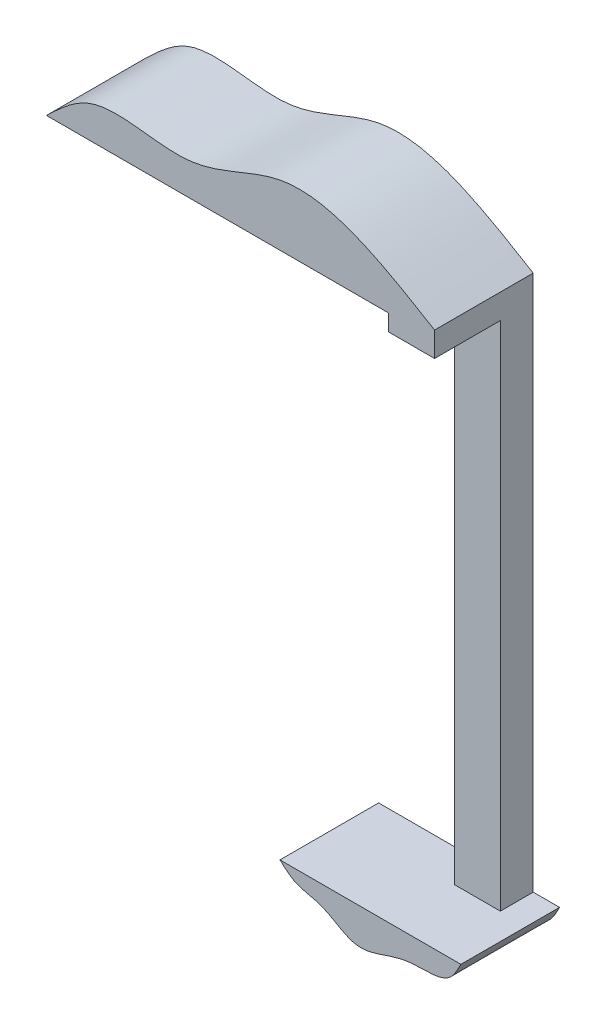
ISO-10303-21;
HEADER;
FILE_DESCRIPTION(('STEP AP214'),'2;1');
FILE_NAME('part.step','',(''),(''),'','','');
FILE_SCHEMA(('AUTOMOTIVE_DESIGN { 1 0 10303 214 1 1 1 1 }'));
ENDSEC;
DATA;
#1=APPLICATION_CONTEXT('core data for automotive mechanical design processes');
#2=APPLICATION_PROTOCOL_DEFINITION('international standard','automotive_design',2000,#1);
#3=PRODUCT_CONTEXT('',#1,'mechanical');
#4=PRODUCT('Part','Part','',(#3));
#5=PRODUCT_RELATED_PRODUCT_CATEGORY('part','',(#4));
#6=PRODUCT_DEFINITION_FORMATION('','',#4);
#7=PRODUCT_DEFINITION_CONTEXT('part definition',#1,'design');
#8=PRODUCT_DEFINITION('design','',#6,#7);
#9=PRODUCT_DEFINITION_SHAPE('','',#8);
#10=(LENGTH_UNIT() NAMED_UNIT(*) SI_UNIT(.MILLI.,.METRE.));
#11=(NAMED_UNIT(*) PLANE_ANGLE_UNIT() SI_UNIT($,.RADIAN.));
#12=(NAMED_UNIT(*) SI_UNIT($,.STERADIAN.) SOLID_ANGLE_UNIT());
#13=UNCERTAINTY_MEASURE_WITH_UNIT(LENGTH_MEASURE(1.E-05),#10,'distance_accuracy_value','');
#14=(GEOMETRIC_REPRESENTATION_CONTEXT(3) GLOBAL_UNCERTAINTY_ASSIGNED_CONTEXT((#13)) GLOBAL_UNIT_ASSIGNED_CONTEXT((#10,
#11,#12)) REPRESENTATION_CONTEXT('',''));
#15=CARTESIAN_POINT('',(0.,0.,0.));
#16=DIRECTION('',(0.,0.,1.));
#17=DIRECTION('',(1.,0.,0.));
#18=AXIS2_PLACEMENT_3D('',#15,#16,#17);
#19=CARTESIAN_POINT('',(-7.53680932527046,-10.4914734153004,30.));
#20=DIRECTION('',(0.,0.,-1.));
#21=DIRECTION('',(-1.,0.,0.));
#22=AXIS2_PLACEMENT_3D('',#19,#20,#21);
#23=PLANE('',#22);
#24=DIRECTION('',(0.,-1.,0.));
#25=VECTOR('',#24,1.);
#26=CARTESIAN_POINT('',(-2.,0.,30.));
#27=LINE('',#26,#25);
#28=CARTESIAN_POINT('',(-2.,160.5,30.));
#29=VERTEX_POINT('',#28);
#30=CARTESIAN_POINT('',(-2.,155.5,30.));
#31=VERTEX_POINT('',#30);
#32=EDGE_CURVE('E119',#29,#31,#27,.T.);
#33=ORIENTED_EDGE('',*,*,#32,.T.);
#34=DIRECTION('',(-1.,0.,0.));
#35=VECTOR('',#34,1.);
#36=CARTESIAN_POINT('',(-14.1,155.5,30.));
#37=LINE('',#36,#35);
#38=CARTESIAN_POINT('',(12.,155.5,30.));
#39=VERTEX_POINT('',#38);
#40=EDGE_CURVE('E107',#39,#31,#37,.T.);
#41=ORIENTED_EDGE('',*,*,#40,.F.);
#42=DIRECTION('',(0.,1.,0.));
#43=VECTOR('',#42,1.);
#44=CARTESIAN_POINT('',(12.,0.,30.));
#45=LINE('',#44,#43);
#46=CARTESIAN_POINT('',(12.,163.,30.));
#47=VERTEX_POINT('',#46);
#48=EDGE_CURVE('E116',#39,#47,#45,.T.);
#49=ORIENTED_EDGE('',*,*,#48,.T.);
#50=CARTESIAN_POINT('',(12.,163.,30.));
#51=CARTESIAN_POINT('',(-3.78610537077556,172.47166546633,30.));
#52=CARTESIAN_POINT('',(-28.8037723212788,187.482269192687,30.));
#53=CARTESIAN_POINT('',(-62.1170521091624,165.146449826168,30.));
#54=CARTESIAN_POINT('',(-89.926880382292,175.83666233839,30.));
#55=CARTESIAN_POINT('',(-101.787873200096,164.519130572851,30.));
#56=CARTESIAN_POINT('',(-106.,160.5,30.));
#57=B_SPLINE_CURVE_WITH_KNOTS('',3,(#50,#51,#52,#53,#54,#55,#56),.UNSPECIFIED.,.F.,.F.,(4,1,1,1,
4),(0.,0.396544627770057,0.628440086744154,0.86805004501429,1.),.UNSPECIFIED.);
#58=CARTESIAN_POINT('',(-106.,160.5,30.));
#59=VERTEX_POINT('',#58);
#60=EDGE_CURVE('E126',#47,#59,#57,.T.);
#61=ORIENTED_EDGE('',*,*,#60,.T.);
#62=DIRECTION('',(1.,0.,0.));
#63=VECTOR('',#62,1.);
#64=CARTESIAN_POINT('',(-2.,160.5,30.));
#65=LINE('',#64,#63);
#66=EDGE_CURVE('E54',#59,#29,#65,.T.);
#67=ORIENTED_EDGE('',*,*,#66,.T.);
#68=EDGE_LOOP('',(#33,#41,#49,#61,#67));
#69=FACE_BOUND('',#68,.T.);
#70=ADVANCED_FACE('F31',(#69),#23,.F.);
#71=CARTESIAN_POINT('',(-35.,0.,30.));
#72=CARTESIAN_POINT('',(-33.5435901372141,-1.33739367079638,30.));
#73=CARTESIAN_POINT('',(-30.0936054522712,-4.50544944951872,30.));
#74=CARTESIAN_POINT('',(-21.2243919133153,-5.05505208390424,30.));
#75=CARTESIAN_POINT('',(-11.0745628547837,-14.0424406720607,30.));
#76=CARTESIAN_POINT('',(1.98997114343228,-5.44906440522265,30.));
#77=CARTESIAN_POINT('',(15.8305218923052,-8.23833926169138,30.));
#78=CARTESIAN_POINT('',(18.9877916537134,-1.99999029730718,30.));
#79=CARTESIAN_POINT('',(20.,0.,30.));
#80=B_SPLINE_CURVE_WITH_KNOTS('',3,(#71,#72,#73,#74,#75,#76,#77,#78,#79),.UNSPECIFIED.,.F.,.F.,
(4,1,1,1,1,1,4),(0.,0.0949203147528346,0.224849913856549,0.420290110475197,0.67892704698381,
0.897065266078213,1.),.UNSPECIFIED.);
#81=DIRECTION('',(0.,0.,-1.));
#82=VECTOR('',#81,1.);
#83=SURFACE_OF_LINEAR_EXTRUSION('',#80,#82);
#84=CARTESIAN_POINT('',(-35.,0.,0.));
#85=CARTESIAN_POINT('',(-33.5435901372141,-1.33739367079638,0.));
#86=CARTESIAN_POINT('',(-30.0936054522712,-4.50544944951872,0.));
#87=CARTESIAN_POINT('',(-21.2243919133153,-5.05505208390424,0.));
#88=CARTESIAN_POINT('',(-11.0745628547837,-14.0424406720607,0.));
#89=CARTESIAN_POINT('',(1.98997114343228,-5.44906440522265,0.));
#90=CARTESIAN_POINT('',(15.8305218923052,-8.23833926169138,0.));
#91=CARTESIAN_POINT('',(18.9877916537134,-1.99999029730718,0.));
#92=CARTESIAN_POINT('',(20.,0.,0.));
#93=B_SPLINE_CURVE_WITH_KNOTS('',3,(#84,#85,#86,#87,#88,#89,#90,#91,#92),.UNSPECIFIED.,.F.,.F.,
(4,1,1,1,1,1,4),(0.,0.0949203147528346,0.224849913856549,0.420290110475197,0.67892704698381,
0.897065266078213,1.),.UNSPECIFIED.);
#94=CARTESIAN_POINT('',(-35.,0.,0.));
#95=VERTEX_POINT('',#94);
#96=CARTESIAN_POINT('',(20.,0.,0.));
#97=VERTEX_POINT('',#96);
#98=EDGE_CURVE('E208',#95,#97,#93,.T.);
#99=ORIENTED_EDGE('',*,*,#98,.T.);
#100=DIRECTION('',(0.,0.,-1.));
#101=VECTOR('',#100,1.);
#102=CARTESIAN_POINT('',(20.,0.,30.));
#103=LINE('',#102,#101);
#104=CARTESIAN_POINT('',(20.,0.,30.));
#105=VERTEX_POINT('',#104);
#106=EDGE_CURVE('E11',#105,#97,#103,.T.);
#107=ORIENTED_EDGE('',*,*,#106,.F.);
#108=CARTESIAN_POINT('',(-35.,0.,30.));
#109=VERTEX_POINT('',#108);
#110=EDGE_CURVE('E129',#109,#105,#80,.T.);
#111=ORIENTED_EDGE('',*,*,#110,.F.);
#112=DIRECTION('',(0.,0.,-1.));
#113=VECTOR('',#112,1.);
#114=CARTESIAN_POINT('',(-35.,0.,30.));
#115=LINE('',#114,#113);
#116=EDGE_CURVE('E174',#109,#95,#115,.T.);
#117=ORIENTED_EDGE('',*,*,#116,.T.);
#118=EDGE_LOOP('',(#99,#107,#111,#117));
#119=FACE_BOUND('',#118,.T.);
#120=ADVANCED_FACE('F33',(#119),#83,.F.);
#121=CARTESIAN_POINT('',(12.,0.,30.));
#122=DIRECTION('',(-1.,0.,0.));
#123=DIRECTION('',(0.,-1.,0.));
#124=AXIS2_PLACEMENT_3D('',#121,#122,#123);
#125=PLANE('',#124);
#126=ORIENTED_EDGE('',*,*,#48,.F.);
#127=DIRECTION('',(0.,0.,1.));
#128=VECTOR('',#127,1.);
#129=CARTESIAN_POINT('',(12.,155.5,10.));
#130=LINE('',#129,#128);
#131=CARTESIAN_POINT('',(12.,155.5,10.));
#132=VERTEX_POINT('',#131);
#133=EDGE_CURVE('E104',#132,#39,#130,.T.);
#134=ORIENTED_EDGE('',*,*,#133,.F.);
#135=DIRECTION('',(0.,1.,0.));
#136=VECTOR('',#135,1.);
#137=CARTESIAN_POINT('',(12.,155.5,10.));
#138=LINE('',#137,#136);
#139=CARTESIAN_POINT('',(12.,0.,10.));
#140=VERTEX_POINT('',#139);
#141=EDGE_CURVE('E219',#140,#132,#138,.T.);
#142=ORIENTED_EDGE('',*,*,#141,.F.);
#143=DIRECTION('',(0.,0.,-1.));
#144=VECTOR('',#143,1.);
#145=CARTESIAN_POINT('',(12.,0.,30.));
#146=LINE('',#145,#144);
#147=CARTESIAN_POINT('',(12.,0.,0.));
#148=VERTEX_POINT('',#147);
#149=EDGE_CURVE('E40',#140,#148,#146,.T.);
#150=ORIENTED_EDGE('',*,*,#149,.T.);
#151=DIRECTION('',(0.,1.,0.));
#152=VECTOR('',#151,1.);
#153=CARTESIAN_POINT('',(12.,0.,0.));
#154=LINE('',#153,#152);
#155=CARTESIAN_POINT('',(12.,163.,0.));
#156=VERTEX_POINT('',#155);
#157=EDGE_CURVE('E200',#148,#156,#154,.T.);
#158=ORIENTED_EDGE('',*,*,#157,.T.);
#159=DIRECTION('',(0.,0.,-1.));
#160=VECTOR('',#159,1.);
#161=CARTESIAN_POINT('',(12.,163.,30.));
#162=LINE('',#161,#160);
#163=EDGE_CURVE('E124',#47,#156,#162,.T.);
#164=ORIENTED_EDGE('',*,*,#163,.F.);
#165=EDGE_LOOP('',(#126,#134,#142,#150,#158,#164));
#166=FACE_BOUND('',#165,.T.);
#167=ADVANCED_FACE('F122',(#166),#125,.F.);
#168=DIRECTION('',(0.,0.,-1.));
#169=VECTOR('',#168,1.);
#170=SURFACE_OF_LINEAR_EXTRUSION('',#57,#169);
#171=CARTESIAN_POINT('',(12.,163.,0.));
#172=CARTESIAN_POINT('',(-3.78610537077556,172.47166546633,0.));
#173=CARTESIAN_POINT('',(-28.8037723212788,187.482269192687,0.));
#174=CARTESIAN_POINT('',(-62.1170521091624,165.146449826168,0.));
#175=CARTESIAN_POINT('',(-89.926880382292,175.83666233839,0.));
#176=CARTESIAN_POINT('',(-101.787873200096,164.519130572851,0.));
#177=CARTESIAN_POINT('',(-106.,160.5,0.));
#178=B_SPLINE_CURVE_WITH_KNOTS('',3,(#171,#172,#173,#174,#175,#176,#177),.UNSPECIFIED.,.F.,.F.,
(4,1,1,1,4),(0.,0.396544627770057,0.628440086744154,0.86805004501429,1.),.UNSPECIFIED.);
#179=CARTESIAN_POINT('',(-106.,160.5,0.));
#180=VERTEX_POINT('',#179);
#181=EDGE_CURVE('E196',#156,#180,#178,.T.);
#182=ORIENTED_EDGE('',*,*,#181,.T.);
#183=DIRECTION('',(0.,0.,-1.));
#184=VECTOR('',#183,1.);
#185=CARTESIAN_POINT('',(-106.,160.5,30.));
#186=LINE('',#185,#184);
#187=EDGE_CURVE('E227',#59,#180,#186,.T.);
#188=ORIENTED_EDGE('',*,*,#187,.F.);
#189=ORIENTED_EDGE('',*,*,#60,.F.);
#190=ORIENTED_EDGE('',*,*,#163,.T.);
#191=EDGE_LOOP('',(#182,#188,#189,#190));
#192=FACE_BOUND('',#191,.T.);
#193=ADVANCED_FACE('F140',(#192),#170,.F.);
#194=CARTESIAN_POINT('',(-2.,160.5,30.));
#195=DIRECTION('',(0.,1.,0.));
#196=DIRECTION('',(0.,0.,1.));
#197=AXIS2_PLACEMENT_3D('',#194,#195,#196);
#198=PLANE('',#197);
#199=DIRECTION('',(1.,0.,0.));
#200=VECTOR('',#199,1.);
#201=CARTESIAN_POINT('',(-2.,160.5,0.));
#202=LINE('',#201,#200);
#203=CARTESIAN_POINT('',(-2.,160.5,0.));
#204=VERTEX_POINT('',#203);
#205=EDGE_CURVE('E194',#180,#204,#202,.T.);
#206=ORIENTED_EDGE('',*,*,#205,.T.);
#207=DIRECTION('',(0.,0.,-1.));
#208=VECTOR('',#207,1.);
#209=CARTESIAN_POINT('',(-2.,160.5,30.));
#210=LINE('',#209,#208);
#211=EDGE_CURVE('E232',#29,#204,#210,.T.);
#212=ORIENTED_EDGE('',*,*,#211,.F.);
#213=ORIENTED_EDGE('',*,*,#66,.F.);
#214=ORIENTED_EDGE('',*,*,#187,.T.);
#215=EDGE_LOOP('',(#206,#212,#213,#214));
#216=FACE_BOUND('',#215,.T.);
#217=ADVANCED_FACE('F143',(#216),#198,.F.);
#218=CARTESIAN_POINT('',(-2.,0.,30.));
#219=DIRECTION('',(1.,0.,0.));
#220=DIRECTION('',(0.,1.,0.));
#221=AXIS2_PLACEMENT_3D('',#218,#219,#220);
#222=PLANE('',#221);
#223=DIRECTION('',(0.,-1.,0.));
#224=VECTOR('',#223,1.);
#225=CARTESIAN_POINT('',(-2.,0.,10.));
#226=LINE('',#225,#224);
#227=CARTESIAN_POINT('',(-2.,155.5,10.));
#228=VERTEX_POINT('',#227);
#229=CARTESIAN_POINT('',(-2.,0.,10.));
#230=VERTEX_POINT('',#229);
#231=EDGE_CURVE('E212',#228,#230,#226,.T.);
#232=ORIENTED_EDGE('',*,*,#231,.F.);
#233=DIRECTION('',(0.,0.,1.));
#234=VECTOR('',#233,1.);
#235=CARTESIAN_POINT('',(-2.,155.5,30.));
#236=LINE('',#235,#234);
#237=EDGE_CURVE('E114',#228,#31,#236,.T.);
#238=ORIENTED_EDGE('',*,*,#237,.T.);
#239=ORIENTED_EDGE('',*,*,#32,.F.);
#240=ORIENTED_EDGE('',*,*,#211,.T.);
#241=DIRECTION('',(0.,-1.,0.));
#242=VECTOR('',#241,1.);
#243=CARTESIAN_POINT('',(-2.,0.,0.));
#244=LINE('',#243,#242);
#245=CARTESIAN_POINT('',(-2.,0.,0.));
#246=VERTEX_POINT('',#245);
#247=EDGE_CURVE('E183',#204,#246,#244,.T.);
#248=ORIENTED_EDGE('',*,*,#247,.T.);
#249=DIRECTION('',(0.,0.,-1.));
#250=VECTOR('',#249,1.);
#251=CARTESIAN_POINT('',(-2.,0.,30.));
#252=LINE('',#251,#250);
#253=EDGE_CURVE('E180',#230,#246,#252,.T.);
#254=ORIENTED_EDGE('',*,*,#253,.F.);
#255=EDGE_LOOP('',(#232,#238,#239,#240,#248,#254));
#256=FACE_BOUND('',#255,.T.);
#257=ADVANCED_FACE('F167',(#256),#222,.F.);
#258=CARTESIAN_POINT('',(-35.,0.,30.));
#259=DIRECTION('',(0.,-1.,0.));
#260=DIRECTION('',(0.,0.,-1.));
#261=AXIS2_PLACEMENT_3D('',#258,#259,#260);
#262=PLANE('',#261);
#263=ORIENTED_EDGE('',*,*,#116,.F.);
#264=DIRECTION('',(-1.,0.,0.));
#265=VECTOR('',#264,1.);
#266=CARTESIAN_POINT('',(12.,0.,30.));
#267=LINE('',#266,#265);
#268=EDGE_CURVE('E46',#105,#109,#267,.T.);
#269=ORIENTED_EDGE('',*,*,#268,.F.);
#270=ORIENTED_EDGE('',*,*,#106,.T.);
#271=DIRECTION('',(-1.,0.,0.));
#272=VECTOR('',#271,1.);
#273=CARTESIAN_POINT('',(12.,0.,0.));
#274=LINE('',#273,#272);
#275=EDGE_CURVE('E205',#97,#148,#274,.T.);
#276=ORIENTED_EDGE('',*,*,#275,.T.);
#277=ORIENTED_EDGE('',*,*,#149,.F.);
#278=DIRECTION('',(1.,0.,0.));
#279=VECTOR('',#278,1.);
#280=CARTESIAN_POINT('',(-14.1,0.,10.));
#281=LINE('',#280,#279);
#282=EDGE_CURVE('E120',#230,#140,#281,.T.);
#283=ORIENTED_EDGE('',*,*,#282,.F.);
#284=ORIENTED_EDGE('',*,*,#253,.T.);
#285=DIRECTION('',(-1.,0.,0.));
#286=VECTOR('',#285,1.);
#287=CARTESIAN_POINT('',(-35.,0.,0.));
#288=LINE('',#287,#286);
#289=EDGE_CURVE('E177',#246,#95,#288,.T.);
#290=ORIENTED_EDGE('',*,*,#289,.T.);
#291=EDGE_LOOP('',(#263,#269,#270,#276,#277,#283,#284,#290));
#292=FACE_BOUND('',#291,.T.);
#293=ADVANCED_FACE('F160',(#292),#262,.F.);
#294=ORIENTED_EDGE('',*,*,#268,.T.);
#295=ORIENTED_EDGE('',*,*,#110,.T.);
#296=EDGE_LOOP('',(#294,#295));
#297=FACE_BOUND('',#296,.T.);
#298=ADVANCED_FACE('F153',(#297),#23,.F.);
#299=CARTESIAN_POINT('',(-7.53680932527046,-10.4914734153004,0.));
#300=DIRECTION('',(0.,0.,-1.));
#301=DIRECTION('',(-1.,0.,0.));
#302=AXIS2_PLACEMENT_3D('',#299,#300,#301);
#303=PLANE('',#302);
#304=ORIENTED_EDGE('',*,*,#98,.F.);
#305=ORIENTED_EDGE('',*,*,#289,.F.);
#306=ORIENTED_EDGE('',*,*,#247,.F.);
#307=ORIENTED_EDGE('',*,*,#205,.F.);
#308=ORIENTED_EDGE('',*,*,#181,.F.);
#309=ORIENTED_EDGE('',*,*,#157,.F.);
#310=ORIENTED_EDGE('',*,*,#275,.F.);
#311=EDGE_LOOP('',(#304,#305,#306,#307,#308,#309,#310));
#312=FACE_BOUND('',#311,.T.);
#313=ADVANCED_FACE('F159',(#312),#303,.T.);
#314=CARTESIAN_POINT('',(-14.1,0.,10.));
#315=DIRECTION('',(0.,0.,1.));
#316=DIRECTION('',(1.,0.,0.));
#317=AXIS2_PLACEMENT_3D('',#314,#315,#316);
#318=PLANE('',#317);
#319=ORIENTED_EDGE('',*,*,#231,.T.);
#320=ORIENTED_EDGE('',*,*,#282,.T.);
#321=ORIENTED_EDGE('',*,*,#141,.T.);
#322=DIRECTION('',(-1.,0.,0.));
#323=VECTOR('',#322,1.);
#324=CARTESIAN_POINT('',(-14.1,155.5,10.));
#325=LINE('',#324,#323);
#326=EDGE_CURVE('E110',#132,#228,#325,.T.);
#327=ORIENTED_EDGE('',*,*,#326,.T.);
#328=EDGE_LOOP('',(#319,#320,#321,#327));
#329=FACE_BOUND('',#328,.T.);
#330=ADVANCED_FACE('F165',(#329),#318,.T.);
#331=CARTESIAN_POINT('',(-14.1,155.5,10.));
#332=DIRECTION('',(0.,1.,0.));
#333=DIRECTION('',(0.,0.,1.));
#334=AXIS2_PLACEMENT_3D('',#331,#332,#333);
#335=PLANE('',#334);
#336=ORIENTED_EDGE('',*,*,#326,.F.);
#337=ORIENTED_EDGE('',*,*,#133,.T.);
#338=ORIENTED_EDGE('',*,*,#40,.T.);
#339=ORIENTED_EDGE('',*,*,#237,.F.);
#340=EDGE_LOOP('',(#336,#337,#338,#339));
#341=FACE_BOUND('',#340,.T.);
#342=ADVANCED_FACE('F106',(#341),#335,.F.);
#343=CLOSED_SHELL('',(#70,#120,#167,#193,#217,#257,#293,#298,#313,#330,#342));
#344=MANIFOLD_SOLID_BREP('B2',#343);
#345=ADVANCED_BREP_SHAPE_REPRESENTATION('',(#18,#344),#14);
#346=SHAPE_DEFINITION_REPRESENTATION(#9,#345);
ENDSEC;
END-ISO-10303-21;
